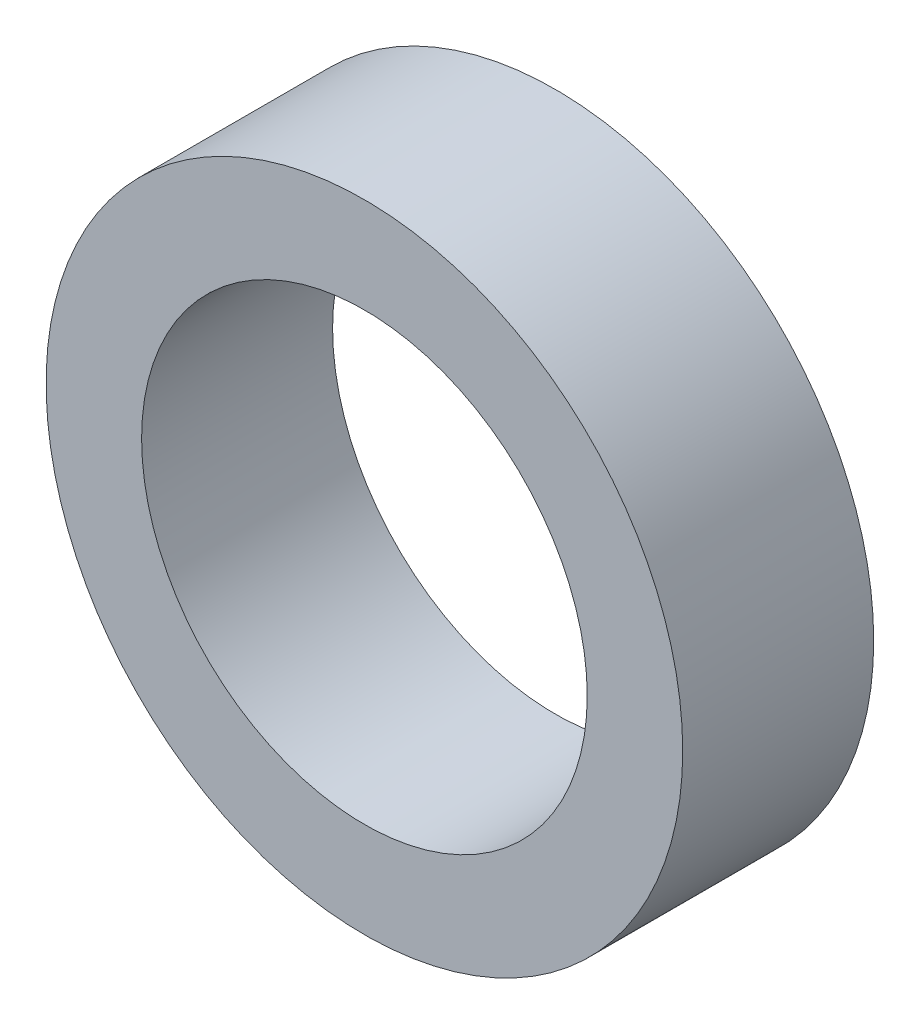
from build123d import *

# Parameters (mm, degrees)
ESQUISSE1_R      = 3
ESQUISSE1_R_2    = 2.1
EXTRUSION1_DEPTH = 1.8


with BuildPart() as part:
    # Esquisse1 → Extrusion1 (new body)
    with BuildSketch(Plane.XY):
        Circle(ESQUISSE1_R)
        Circle(ESQUISSE1_R_2, mode=Mode.SUBTRACT)
    extrude(amount=EXTRUSION1_DEPTH)


solid = part.part
